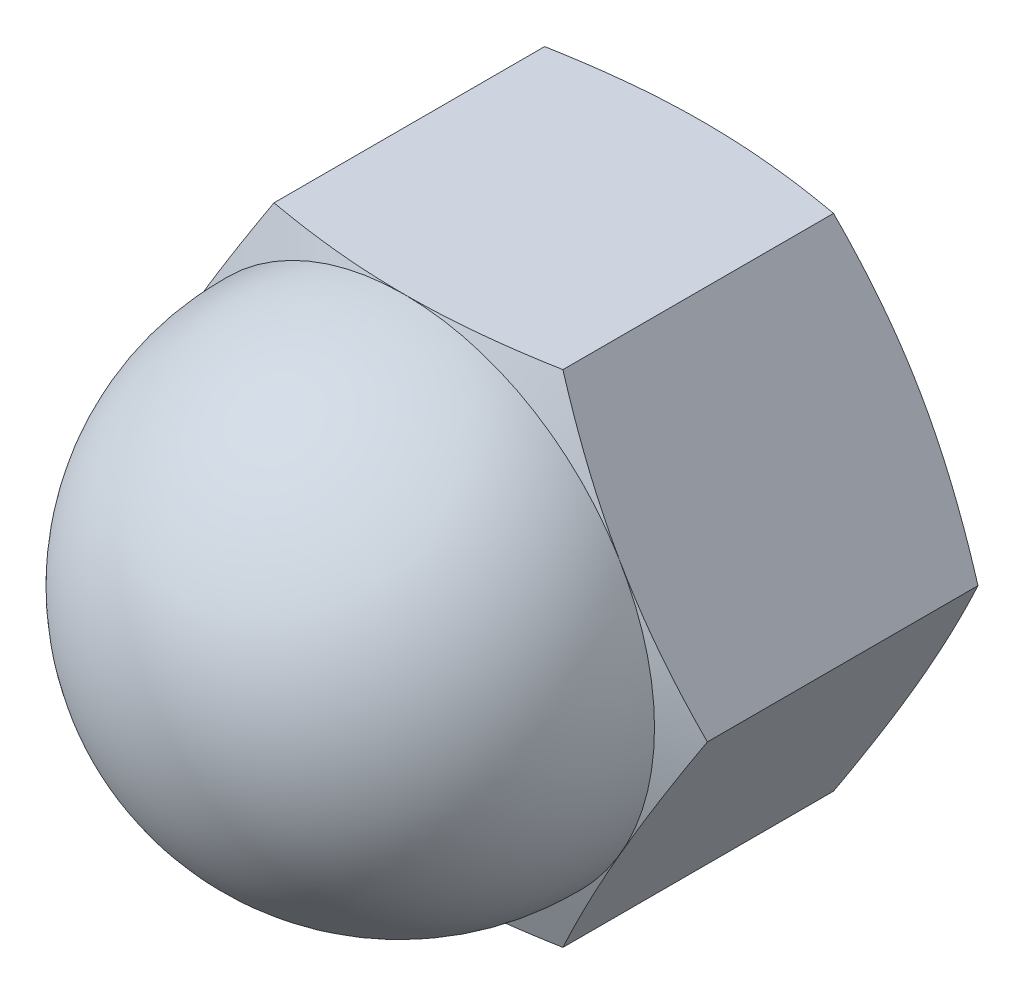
from build123d import *

# Parameters (mm, degrees)
SKETCH1_R        = 3.3235
BASENUT_DEPTH    = 8
ENDCHAMFER_SIZE  = 0.8765
ENDCHAMFER_SIZE2 = 0.506047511


with BuildPart() as part:
    # Sketch1 → BaseNut (new body)
    with BuildSketch(Plane.XY):
        Polygon((7.505553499, 0), (3.75277675, 6.5), (-3.75277675, 6.5), (-7.505553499, 0), (-3.75277675, -6.5), (3.75277675, -6.5), align=None)
        Circle(SKETCH1_R, mode=Mode.SUBTRACT)
    extrude(amount=-BASENUT_DEPTH)

    # Sketch2 → DoubleChamfer (revolve, cut)
    with BuildSketch(Plane(origin=(0, 0, 0), x_dir=(1, 0, 0), z_dir=(0, 1, 0))):
        Polygon((-6.175, 8), (-7.505553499, 8), (-7.505553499, 7.515718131), align=None)
        Polygon((-7.505553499, 0.484281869), (-6.175, 0), (-7.505553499, 0), align=None)
    revolve(axis=Axis((0, 0, -11.569441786), (0, 0, 1)), mode=Mode.SUBTRACT)

    # Sketch3 → Crown (revolve)
    with BuildSketch(Plane(origin=(-4.6, 0, -7.917622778), x_dir=(-1, 0, 0), z_dir=(0, 1, 0))):
        with BuildLine():
            Line((-4.6, 5.917622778), (-10.784658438, 5.917622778))
            ThreePointArc((-10.784658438, 5.917622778), (-9.85594901, 11.741887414), (-4.6, 14.417622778))
            Line((-4.6, 14.417622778), (-4.6, 5.917622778))
        make_face()
    revolve(axis=Axis((0, 0, -2.849184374), (0, 0, 1)))

    # EndChamfer
    endchamfer_edges = [part.edges().sort_by_distance(p)[0] for p in [
        (-3.3235, 0, -8),
    ]]
    endchamfer_side = [part.faces().sort_by_distance(p)[0] for p in [
        (-3.3235, 0, -5),
    ]]
    chamfer(endchamfer_edges, length=ENDCHAMFER_SIZE, length2=ENDCHAMFER_SIZE2, reference=endchamfer_side[0])


solid = part.part
